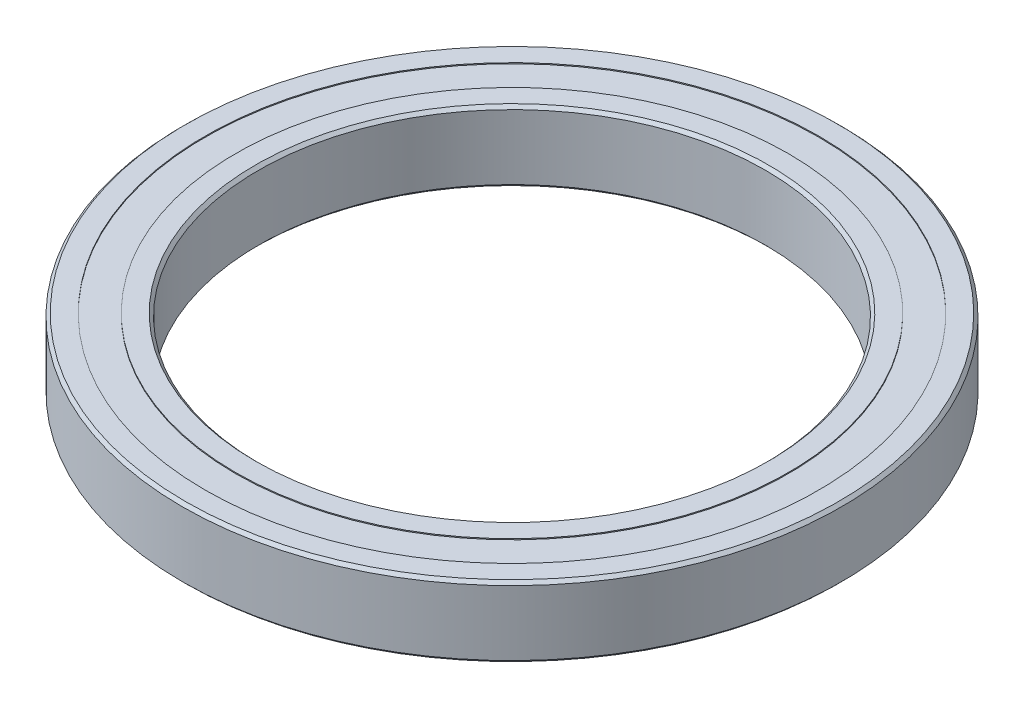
from build123d import *

# Parameters (mm, degrees)
SKETCH_1_R          = 32.5
SKETCH_1_R_2        = 25
EXTRUDE_1_DEPTH     = 7
CHAMFER_1_SIZE      = 0.3
SKETCH_2_R          = 30.25
SKETCH_2_R_2        = 27.25
CUT_EXTRUDE_1_DEPTH = 0.1
CUT_EXTRUDE_START   = -0.1
SKETCH_3_R          = 30.25
SKETCH_3_R_2        = 27.25
CUT_EXTRUDE_2_DEPTH = 0.1


with BuildPart() as part:
    # Sketch 1 → Extrude 1 (new body)
    with BuildSketch(Plane(origin=(0, 0, 0), x_dir=(1, 0, 0), z_dir=(0, 1, 0))):
        with Locations(Location((0, 0, 0), (0, 0, 270))):
            Circle(SKETCH_1_R)
        with Locations(Location((0, 0, 0), (0, 0, 270))):
            Circle(SKETCH_1_R_2, mode=Mode.SUBTRACT)
    extrude(amount=EXTRUDE_1_DEPTH)

    # Chamfer 1
    chamfer_1_edges = [part.edges().sort_by_distance(p)[0] for p in [
        (0, 0, -32.5),
        (0, 7, -32.5),
        (0, 0, -25),
        (0, 7, -25),
    ]]
    chamfer(chamfer_1_edges, length=CHAMFER_1_SIZE)

    # Sketch 2 → Cut-Extrude 1 (cut)
    with BuildSketch(Plane(origin=(0, 7, 0), x_dir=(1, 0, 0), z_dir=(0, 1, 0))):
        with Locations(Location((0, 0, 0), (0, 0, 270))):
            Circle(SKETCH_2_R)
        with Locations(Location((0, 0, 0), (0, 0, 270))):
            Circle(SKETCH_2_R_2, mode=Mode.SUBTRACT)
    extrude(amount=-CUT_EXTRUDE_1_DEPTH, mode=Mode.SUBTRACT)

    # Sketch 3 → Cut-Extrude 2 (cut)
    with BuildSketch(Plane.XZ.offset(CUT_EXTRUDE_START)):
        with Locations(Location((0, 0, 0), (0, 0, 90))):
            Circle(SKETCH_3_R)
        with Locations(Location((0, 0, 0), (0, 0, 90))):
            Circle(SKETCH_3_R_2, mode=Mode.SUBTRACT)
    extrude(amount=CUT_EXTRUDE_2_DEPTH, mode=Mode.SUBTRACT)


solid = part.part
